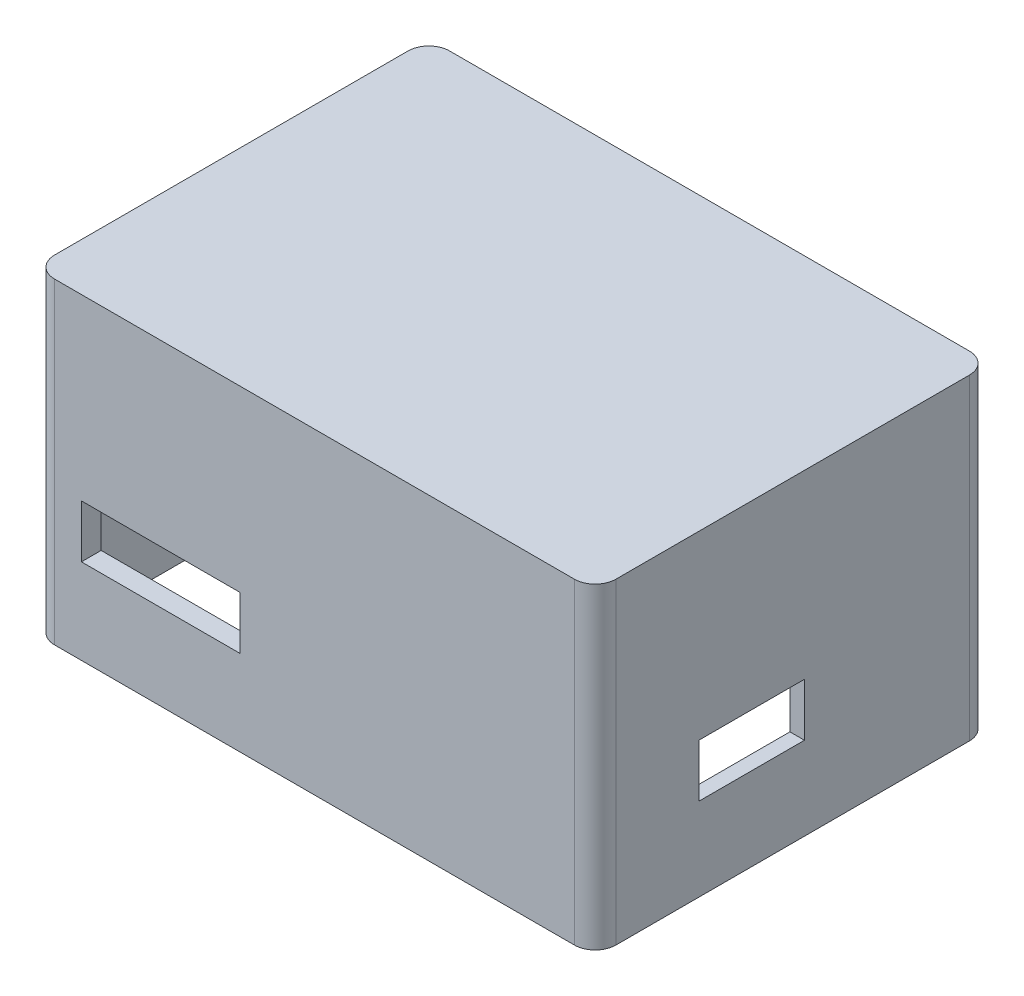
from build123d import *

# Parameters (mm, degrees)
SKETCH1_W           = 135
SKETCH1_H           = 95
BOSS_EXTRUDE1_DEPTH = 76.2
SKETCH4_W           = 128.436224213
SKETCH4_H           = 85.4
CUT_EXTRUDE2_DEPTH  = 63.5
FILLET1_R           = 5
SKETCH6_W           = 38.1
SKETCH6_H           = 12.7
CUT_EXTRUDE3_DEPTH  = 180.37977639
SKETCH7_W           = 25.4
SKETCH7_H           = 12.7
CUT_EXTRUDE4_DEPTH  = 180.230828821
SKETCH8_W           = 44.45
SKETCH8_H           = 19.05
CUT_EXTRUDE5_DEPTH  = 10
FILLET2_R           = 6.35


with BuildPart() as part:
    # Sketch1 → Boss-Extrude1 (new body)
    with BuildSketch(Plane(origin=(0, 0, 0), x_dir=(1, 0, 0), z_dir=(0, 1, 0))):
        with Locations((67.5, 47.5)):
            Rectangle(SKETCH1_W, SKETCH1_H)
    extrude(amount=BOSS_EXTRUDE1_DEPTH)

    # Sketch4 → Cut-Extrude2 (cut)
    with BuildSketch(Plane.XZ):
        with Locations((67.281887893, -47.446666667)):
            Rectangle(SKETCH4_W, SKETCH4_H)
    extrude(amount=-CUT_EXTRUDE2_DEPTH, mode=Mode.SUBTRACT)

    # Fillet1
    fillet1_edges = [part.edges().sort_by_distance(p)[0] for p in [
        (0, 38.1, -95),
        (135, 38.1, -95),
        (135, 38.1, 0),
        (0, 38.1, 0),
    ]]
    fillet(fillet1_edges, radius=FILLET1_R)

    # Sketch6 → Cut-Extrude3 (cut, through all)
    with BuildSketch(Plane(origin=(0, 0, -4.746666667), x_dir=(-1, 0, 0), z_dir=(0, 0, -1))):
        with Locations((-30.506941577, 26.884434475)):
            Rectangle(SKETCH6_W, SKETCH6_H)
    extrude(amount=-CUT_EXTRUDE3_DEPTH, mode=Mode.SUBTRACT)

    # Sketch7 → Cut-Extrude4 (cut, through all)
    with BuildSketch(Plane.ZY.offset(-131.5)):
        with Locations((-37.628532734, 26.336282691)):
            Rectangle(SKETCH7_W, SKETCH7_H)
    extrude(amount=-CUT_EXTRUDE4_DEPTH, mode=Mode.SUBTRACT)

    # Sketch8 → Cut-Extrude5 (cut)
    with BuildSketch(Plane(origin=(0, 0, -95), x_dir=(-1, 0, 0), z_dir=(0, 0, -1))):
        with Locations((-68.672051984, 49.488312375)):
            Rectangle(SKETCH8_W, SKETCH8_H)
    extrude(amount=-CUT_EXTRUDE5_DEPTH, mode=Mode.SUBTRACT)

    # Fillet2
    fillet2_edges = [part.edges().sort_by_distance(p)[0] for p in [
        (90.897051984, 39.963312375, -92.573333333),
        (90.897051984, 59.013312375, -92.573333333),
        (46.447051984, 59.013312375, -92.573333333),
        (46.447051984, 39.963312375, -92.573333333),
    ]]
    fillet(fillet2_edges, radius=FILLET2_R)


solid = part.part
